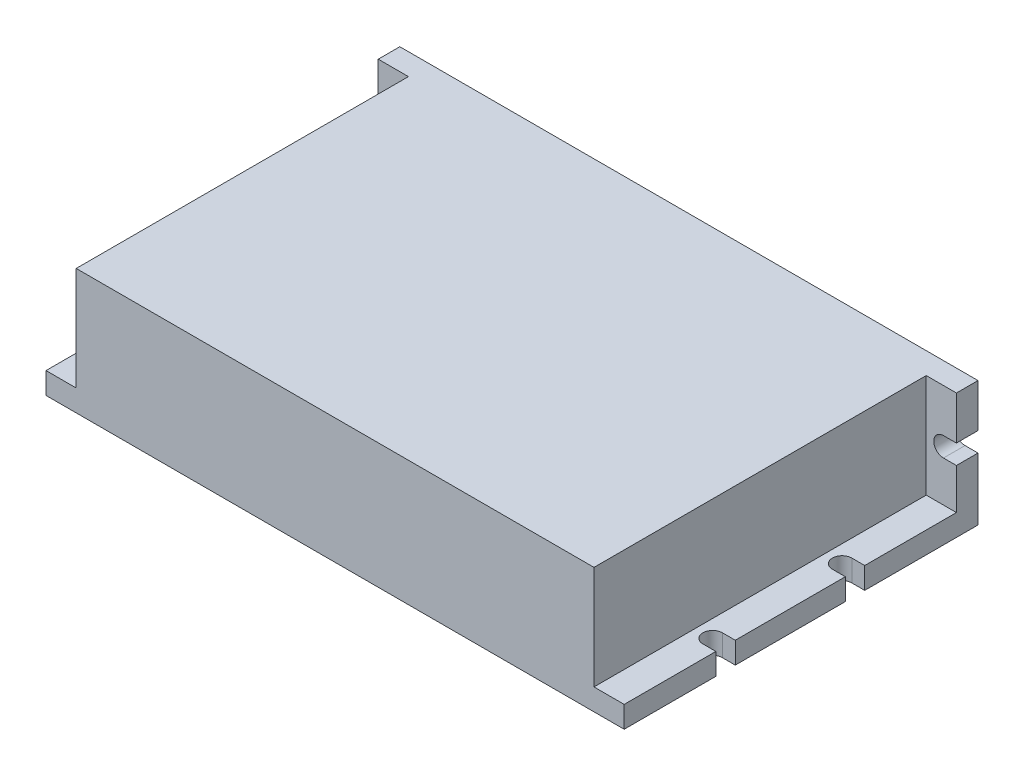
ISO-10303-21;
HEADER;
FILE_DESCRIPTION(('STEP AP214'),'2;1');
FILE_NAME('part.step','',(''),(''),'','','');
FILE_SCHEMA(('AUTOMOTIVE_DESIGN { 1 0 10303 214 1 1 1 1 }'));
ENDSEC;
DATA;
#1=APPLICATION_CONTEXT('core data for automotive mechanical design processes');
#2=APPLICATION_PROTOCOL_DEFINITION('international standard','automotive_design',2000,#1);
#3=PRODUCT_CONTEXT('',#1,'mechanical');
#4=PRODUCT('Part','Part','',(#3));
#5=PRODUCT_RELATED_PRODUCT_CATEGORY('part','',(#4));
#6=PRODUCT_DEFINITION_FORMATION('','',#4);
#7=PRODUCT_DEFINITION_CONTEXT('part definition',#1,'design');
#8=PRODUCT_DEFINITION('design','',#6,#7);
#9=PRODUCT_DEFINITION_SHAPE('','',#8);
#10=(LENGTH_UNIT() NAMED_UNIT(*) SI_UNIT(.MILLI.,.METRE.));
#11=(NAMED_UNIT(*) PLANE_ANGLE_UNIT() SI_UNIT($,.RADIAN.));
#12=(NAMED_UNIT(*) SI_UNIT($,.STERADIAN.) SOLID_ANGLE_UNIT());
#13=UNCERTAINTY_MEASURE_WITH_UNIT(LENGTH_MEASURE(1.E-05),#10,'distance_accuracy_value','');
#14=(GEOMETRIC_REPRESENTATION_CONTEXT(3) GLOBAL_UNCERTAINTY_ASSIGNED_CONTEXT((#13)) GLOBAL_UNIT_ASSIGNED_CONTEXT((#10,
#11,#12)) REPRESENTATION_CONTEXT('',''));
#15=CARTESIAN_POINT('',(0.,0.,0.));
#16=DIRECTION('',(0.,0.,1.));
#17=DIRECTION('',(1.,0.,0.));
#18=AXIS2_PLACEMENT_3D('',#15,#16,#17);
#19=CARTESIAN_POINT('',(134.,29.,0.));
#20=DIRECTION('',(-1.,0.,0.));
#21=DIRECTION('',(0.,0.,1.));
#22=AXIS2_PLACEMENT_3D('',#19,#20,#21);
#23=PLANE('',#22);
#24=DIRECTION('',(0.,0.,1.));
#25=VECTOR('',#24,1.);
#26=CARTESIAN_POINT('',(134.,5.,-77.));
#27=LINE('',#26,#25);
#28=CARTESIAN_POINT('',(134.,5.,-51.25));
#29=VERTEX_POINT('',#28);
#30=CARTESIAN_POINT('',(134.,5.,-25.75));
#31=VERTEX_POINT('',#30);
#32=EDGE_CURVE('E442',#29,#31,#27,.T.);
#33=ORIENTED_EDGE('',*,*,#32,.T.);
#34=DIRECTION('',(0.,1.,0.));
#35=VECTOR('',#34,1.);
#36=CARTESIAN_POINT('',(134.,0.,-25.75));
#37=LINE('',#36,#35);
#38=CARTESIAN_POINT('',(134.,0.,-25.75));
#39=VERTEX_POINT('',#38);
#40=EDGE_CURVE('E286',#39,#31,#37,.T.);
#41=ORIENTED_EDGE('',*,*,#40,.F.);
#42=DIRECTION('',(0.,0.,-1.));
#43=VECTOR('',#42,1.);
#44=CARTESIAN_POINT('',(134.,0.,0.));
#45=LINE('',#44,#43);
#46=CARTESIAN_POINT('',(134.,0.,-51.25));
#47=VERTEX_POINT('',#46);
#48=EDGE_CURVE('E495',#39,#47,#45,.T.);
#49=ORIENTED_EDGE('',*,*,#48,.T.);
#50=DIRECTION('',(0.,1.,0.));
#51=VECTOR('',#50,1.);
#52=CARTESIAN_POINT('',(134.,0.,-51.25));
#53=LINE('',#52,#51);
#54=EDGE_CURVE('E310',#47,#29,#53,.T.);
#55=ORIENTED_EDGE('',*,*,#54,.T.);
#56=EDGE_LOOP('',(#33,#41,#49,#55));
#57=FACE_BOUND('',#56,.T.);
#58=ADVANCED_FACE('F35',(#57),#23,.F.);
#59=CARTESIAN_POINT('',(134.,5.,-77.));
#60=VERTEX_POINT('',#59);
#61=CARTESIAN_POINT('',(134.,5.,-55.75));
#62=VERTEX_POINT('',#61);
#63=EDGE_CURVE('E438',#60,#62,#27,.T.);
#64=ORIENTED_EDGE('',*,*,#63,.T.);
#65=DIRECTION('',(0.,1.,0.));
#66=VECTOR('',#65,1.);
#67=CARTESIAN_POINT('',(134.,0.,-55.75));
#68=LINE('',#67,#66);
#69=CARTESIAN_POINT('',(134.,0.,-55.75));
#70=VERTEX_POINT('',#69);
#71=EDGE_CURVE('E308',#70,#62,#68,.T.);
#72=ORIENTED_EDGE('',*,*,#71,.F.);
#73=CARTESIAN_POINT('',(134.,0.,-82.));
#74=VERTEX_POINT('',#73);
#75=EDGE_CURVE('E492',#70,#74,#45,.T.);
#76=ORIENTED_EDGE('',*,*,#75,.T.);
#77=DIRECTION('',(0.,-1.,0.));
#78=VECTOR('',#77,1.);
#79=CARTESIAN_POINT('',(134.,29.,-82.));
#80=LINE('',#79,#78);
#81=CARTESIAN_POINT('',(134.,14.45,-82.));
#82=VERTEX_POINT('',#81);
#83=EDGE_CURVE('E501',#82,#74,#80,.T.);
#84=ORIENTED_EDGE('',*,*,#83,.F.);
#85=DIRECTION('',(0.,0.,1.));
#86=VECTOR('',#85,1.);
#87=CARTESIAN_POINT('',(134.,14.45,-129.));
#88=LINE('',#87,#86);
#89=CARTESIAN_POINT('',(134.,14.45,-77.));
#90=VERTEX_POINT('',#89);
#91=EDGE_CURVE('E401',#82,#90,#88,.T.);
#92=ORIENTED_EDGE('',*,*,#91,.T.);
#93=DIRECTION('',(0.,1.,0.));
#94=VECTOR('',#93,1.);
#95=CARTESIAN_POINT('',(134.,29.,-77.));
#96=LINE('',#95,#94);
#97=EDGE_CURVE('E419',#60,#90,#96,.T.);
#98=ORIENTED_EDGE('',*,*,#97,.F.);
#99=EDGE_LOOP('',(#64,#72,#76,#84,#92,#98));
#100=FACE_BOUND('',#99,.T.);
#101=ADVANCED_FACE('F547',(#100),#23,.F.);
#102=CARTESIAN_POINT('',(0.,29.,0.));
#103=DIRECTION('',(1.,0.,0.));
#104=DIRECTION('',(0.,0.,-1.));
#105=AXIS2_PLACEMENT_3D('',#102,#103,#104);
#106=PLANE('',#105);
#107=DIRECTION('',(0.,0.,1.));
#108=VECTOR('',#107,1.);
#109=CARTESIAN_POINT('',(0.,5.,-77.));
#110=LINE('',#109,#108);
#111=CARTESIAN_POINT('',(0.,5.,-51.25));
#112=VERTEX_POINT('',#111);
#113=CARTESIAN_POINT('',(0.,5.,-25.75));
#114=VERTEX_POINT('',#113);
#115=EDGE_CURVE('E472',#112,#114,#110,.T.);
#116=ORIENTED_EDGE('',*,*,#115,.F.);
#117=DIRECTION('',(0.,1.,0.));
#118=VECTOR('',#117,1.);
#119=CARTESIAN_POINT('',(0.,0.,-51.25));
#120=LINE('',#119,#118);
#121=CARTESIAN_POINT('',(0.,0.,-51.25));
#122=VERTEX_POINT('',#121);
#123=EDGE_CURVE('E333',#122,#112,#120,.T.);
#124=ORIENTED_EDGE('',*,*,#123,.F.);
#125=DIRECTION('',(0.,0.,1.));
#126=VECTOR('',#125,1.);
#127=CARTESIAN_POINT('',(0.,0.,0.));
#128=LINE('',#127,#126);
#129=CARTESIAN_POINT('',(0.,0.,-25.75));
#130=VERTEX_POINT('',#129);
#131=EDGE_CURVE('E489',#122,#130,#128,.T.);
#132=ORIENTED_EDGE('',*,*,#131,.T.);
#133=DIRECTION('',(0.,1.,0.));
#134=VECTOR('',#133,1.);
#135=CARTESIAN_POINT('',(0.,0.,-25.75));
#136=LINE('',#135,#134);
#137=EDGE_CURVE('E362',#130,#114,#136,.T.);
#138=ORIENTED_EDGE('',*,*,#137,.T.);
#139=EDGE_LOOP('',(#116,#124,#132,#138));
#140=FACE_BOUND('',#139,.T.);
#141=ADVANCED_FACE('F522',(#140),#106,.F.);
#142=CARTESIAN_POINT('',(0.,5.,-21.25));
#143=VERTEX_POINT('',#142);
#144=CARTESIAN_POINT('',(0.,5.,0.));
#145=VERTEX_POINT('',#144);
#146=EDGE_CURVE('E458',#143,#145,#110,.T.);
#147=ORIENTED_EDGE('',*,*,#146,.F.);
#148=DIRECTION('',(0.,1.,0.));
#149=VECTOR('',#148,1.);
#150=CARTESIAN_POINT('',(0.,0.,-21.25));
#151=LINE('',#150,#149);
#152=CARTESIAN_POINT('',(0.,0.,-21.25));
#153=VERTEX_POINT('',#152);
#154=EDGE_CURVE('E360',#153,#143,#151,.T.);
#155=ORIENTED_EDGE('',*,*,#154,.F.);
#156=CARTESIAN_POINT('',(0.,0.,0.));
#157=VERTEX_POINT('',#156);
#158=EDGE_CURVE('E466',#153,#157,#128,.T.);
#159=ORIENTED_EDGE('',*,*,#158,.T.);
#160=DIRECTION('',(0.,-1.,0.));
#161=VECTOR('',#160,1.);
#162=CARTESIAN_POINT('',(0.,29.,0.));
#163=LINE('',#162,#161);
#164=EDGE_CURVE('E11',#145,#157,#163,.T.);
#165=ORIENTED_EDGE('',*,*,#164,.F.);
#166=EDGE_LOOP('',(#147,#155,#159,#165));
#167=FACE_BOUND('',#166,.T.);
#168=ADVANCED_FACE('F539',(#167),#106,.F.);
#169=DIRECTION('',(0.,-1.,0.));
#170=VECTOR('',#169,1.);
#171=CARTESIAN_POINT('',(0.,29.,-82.));
#172=LINE('',#171,#170);
#173=CARTESIAN_POINT('',(0.,29.,-82.));
#174=VERTEX_POINT('',#173);
#175=CARTESIAN_POINT('',(0.,18.95,-82.));
#176=VERTEX_POINT('',#175);
#177=EDGE_CURVE('E498',#174,#176,#172,.T.);
#178=ORIENTED_EDGE('',*,*,#177,.T.);
#179=DIRECTION('',(0.,0.,1.));
#180=VECTOR('',#179,1.);
#181=CARTESIAN_POINT('',(0.,18.95,-129.));
#182=LINE('',#181,#180);
#183=CARTESIAN_POINT('',(0.,18.95,-77.));
#184=VERTEX_POINT('',#183);
#185=EDGE_CURVE('E375',#176,#184,#182,.T.);
#186=ORIENTED_EDGE('',*,*,#185,.T.);
#187=DIRECTION('',(0.,-1.,0.));
#188=VECTOR('',#187,1.);
#189=CARTESIAN_POINT('',(0.,29.,-77.));
#190=LINE('',#189,#188);
#191=CARTESIAN_POINT('',(0.,29.,-77.));
#192=VERTEX_POINT('',#191);
#193=EDGE_CURVE('E447',#192,#184,#190,.T.);
#194=ORIENTED_EDGE('',*,*,#193,.F.);
#195=DIRECTION('',(0.,0.,1.));
#196=VECTOR('',#195,1.);
#197=CARTESIAN_POINT('',(0.,29.,0.));
#198=LINE('',#197,#196);
#199=EDGE_CURVE('E473',#174,#192,#198,.T.);
#200=ORIENTED_EDGE('',*,*,#199,.F.);
#201=EDGE_LOOP('',(#178,#186,#194,#200));
#202=FACE_BOUND('',#201,.T.);
#203=ADVANCED_FACE('F541',(#202),#106,.F.);
#204=CARTESIAN_POINT('',(134.,0.,0.));
#205=VERTEX_POINT('',#204);
#206=CARTESIAN_POINT('',(134.,0.,-21.25));
#207=VERTEX_POINT('',#206);
#208=EDGE_CURVE('E493',#205,#207,#45,.T.);
#209=ORIENTED_EDGE('',*,*,#208,.T.);
#210=DIRECTION('',(0.,1.,0.));
#211=VECTOR('',#210,1.);
#212=CARTESIAN_POINT('',(134.,0.,-21.25));
#213=LINE('',#212,#211);
#214=CARTESIAN_POINT('',(134.,5.,-21.25));
#215=VERTEX_POINT('',#214);
#216=EDGE_CURVE('E262',#207,#215,#213,.T.);
#217=ORIENTED_EDGE('',*,*,#216,.T.);
#218=CARTESIAN_POINT('',(134.,5.,0.));
#219=VERTEX_POINT('',#218);
#220=EDGE_CURVE('E443',#215,#219,#27,.T.);
#221=ORIENTED_EDGE('',*,*,#220,.T.);
#222=DIRECTION('',(0.,-1.,0.));
#223=VECTOR('',#222,1.);
#224=CARTESIAN_POINT('',(134.,29.,0.));
#225=LINE('',#224,#223);
#226=EDGE_CURVE('E43',#219,#205,#225,.T.);
#227=ORIENTED_EDGE('',*,*,#226,.T.);
#228=EDGE_LOOP('',(#209,#217,#221,#227));
#229=FACE_BOUND('',#228,.T.);
#230=ADVANCED_FACE('F506',(#229),#23,.F.);
#231=CARTESIAN_POINT('',(0.,0.,-82.));
#232=VERTEX_POINT('',#231);
#233=CARTESIAN_POINT('',(0.,0.,-55.75));
#234=VERTEX_POINT('',#233);
#235=EDGE_CURVE('E485',#232,#234,#128,.T.);
#236=ORIENTED_EDGE('',*,*,#235,.T.);
#237=DIRECTION('',(0.,1.,0.));
#238=VECTOR('',#237,1.);
#239=CARTESIAN_POINT('',(0.,0.,-55.75));
#240=LINE('',#239,#238);
#241=CARTESIAN_POINT('',(0.,5.,-55.75));
#242=VERTEX_POINT('',#241);
#243=EDGE_CURVE('E335',#234,#242,#240,.T.);
#244=ORIENTED_EDGE('',*,*,#243,.T.);
#245=CARTESIAN_POINT('',(0.,5.,-77.));
#246=VERTEX_POINT('',#245);
#247=EDGE_CURVE('E469',#246,#242,#110,.T.);
#248=ORIENTED_EDGE('',*,*,#247,.F.);
#249=CARTESIAN_POINT('',(0.,14.45,-77.));
#250=VERTEX_POINT('',#249);
#251=EDGE_CURVE('E451',#250,#246,#190,.T.);
#252=ORIENTED_EDGE('',*,*,#251,.F.);
#253=DIRECTION('',(0.,0.,1.));
#254=VECTOR('',#253,1.);
#255=CARTESIAN_POINT('',(0.,14.45,-129.));
#256=LINE('',#255,#254);
#257=CARTESIAN_POINT('',(0.,14.45,-82.));
#258=VERTEX_POINT('',#257);
#259=EDGE_CURVE('E374',#258,#250,#256,.T.);
#260=ORIENTED_EDGE('',*,*,#259,.F.);
#261=EDGE_CURVE('E484',#258,#232,#172,.T.);
#262=ORIENTED_EDGE('',*,*,#261,.T.);
#263=EDGE_LOOP('',(#236,#244,#248,#252,#260,#262));
#264=FACE_BOUND('',#263,.T.);
#265=ADVANCED_FACE('F37',(#264),#106,.F.);
#266=CARTESIAN_POINT('',(0.,29.,0.));
#267=DIRECTION('',(0.,0.,-1.));
#268=DIRECTION('',(-1.,0.,0.));
#269=AXIS2_PLACEMENT_3D('',#266,#267,#268);
#270=PLANE('',#269);
#271=ORIENTED_EDGE('',*,*,#226,.F.);
#272=DIRECTION('',(1.,0.,0.));
#273=VECTOR('',#272,1.);
#274=CARTESIAN_POINT('',(134.,5.,0.));
#275=LINE('',#274,#273);
#276=CARTESIAN_POINT('',(127.,5.,0.));
#277=VERTEX_POINT('',#276);
#278=EDGE_CURVE('E435',#277,#219,#275,.T.);
#279=ORIENTED_EDGE('',*,*,#278,.F.);
#280=DIRECTION('',(0.,-1.,0.));
#281=VECTOR('',#280,1.);
#282=CARTESIAN_POINT('',(127.,29.,0.));
#283=LINE('',#282,#281);
#284=CARTESIAN_POINT('',(127.,29.,0.));
#285=VERTEX_POINT('',#284);
#286=EDGE_CURVE('E418',#285,#277,#283,.T.);
#287=ORIENTED_EDGE('',*,*,#286,.F.);
#288=DIRECTION('',(1.,0.,0.));
#289=VECTOR('',#288,1.);
#290=CARTESIAN_POINT('',(0.,29.,0.));
#291=LINE('',#290,#289);
#292=CARTESIAN_POINT('',(7.,29.,0.));
#293=VERTEX_POINT('',#292);
#294=EDGE_CURVE('E476',#293,#285,#291,.T.);
#295=ORIENTED_EDGE('',*,*,#294,.F.);
#296=DIRECTION('',(0.,1.,0.));
#297=VECTOR('',#296,1.);
#298=CARTESIAN_POINT('',(7.,29.,0.));
#299=LINE('',#298,#297);
#300=CARTESIAN_POINT('',(7.,5.,0.));
#301=VERTEX_POINT('',#300);
#302=EDGE_CURVE('E461',#301,#293,#299,.T.);
#303=ORIENTED_EDGE('',*,*,#302,.F.);
#304=DIRECTION('',(1.,0.,0.));
#305=VECTOR('',#304,1.);
#306=CARTESIAN_POINT('',(0.,5.,0.));
#307=LINE('',#306,#305);
#308=EDGE_CURVE('E441',#145,#301,#307,.T.);
#309=ORIENTED_EDGE('',*,*,#308,.F.);
#310=ORIENTED_EDGE('',*,*,#164,.T.);
#311=DIRECTION('',(1.,0.,0.));
#312=VECTOR('',#311,1.);
#313=CARTESIAN_POINT('',(0.,0.,0.));
#314=LINE('',#313,#312);
#315=EDGE_CURVE('E488',#157,#205,#314,.T.);
#316=ORIENTED_EDGE('',*,*,#315,.T.);
#317=EDGE_LOOP('',(#271,#279,#287,#295,#303,#309,#310,#316));
#318=FACE_BOUND('',#317,.T.);
#319=ADVANCED_FACE('F511',(#318),#270,.F.);
#320=CARTESIAN_POINT('',(134.,18.95,-77.));
#321=VERTEX_POINT('',#320);
#322=CARTESIAN_POINT('',(134.,29.,-77.));
#323=VERTEX_POINT('',#322);
#324=EDGE_CURVE('E423',#321,#323,#96,.T.);
#325=ORIENTED_EDGE('',*,*,#324,.F.);
#326=DIRECTION('',(0.,0.,1.));
#327=VECTOR('',#326,1.);
#328=CARTESIAN_POINT('',(134.,18.95,-129.));
#329=LINE('',#328,#327);
#330=CARTESIAN_POINT('',(134.,18.95,-82.));
#331=VERTEX_POINT('',#330);
#332=EDGE_CURVE('E400',#331,#321,#329,.T.);
#333=ORIENTED_EDGE('',*,*,#332,.F.);
#334=CARTESIAN_POINT('',(134.,29.,-82.));
#335=VERTEX_POINT('',#334);
#336=EDGE_CURVE('E502',#335,#331,#80,.T.);
#337=ORIENTED_EDGE('',*,*,#336,.F.);
#338=DIRECTION('',(0.,0.,-1.));
#339=VECTOR('',#338,1.);
#340=CARTESIAN_POINT('',(134.,29.,0.));
#341=LINE('',#340,#339);
#342=EDGE_CURVE('E480',#323,#335,#341,.T.);
#343=ORIENTED_EDGE('',*,*,#342,.F.);
#344=EDGE_LOOP('',(#325,#333,#337,#343));
#345=FACE_BOUND('',#344,.T.);
#346=ADVANCED_FACE('F551',(#345),#23,.F.);
#347=CARTESIAN_POINT('',(0.,29.,-82.));
#348=DIRECTION('',(0.,0.,1.));
#349=DIRECTION('',(1.,0.,0.));
#350=AXIS2_PLACEMENT_3D('',#347,#348,#349);
#351=PLANE('',#350);
#352=CARTESIAN_POINT('',(3.,16.7,-82.));
#353=DIRECTION('',(0.,0.,1.));
#354=DIRECTION('',(1.,0.,0.));
#355=AXIS2_PLACEMENT_3D('',#352,#353,#354);
#356=CIRCLE('',#355,2.25);
#357=CARTESIAN_POINT('',(3.,14.45,-82.));
#358=VERTEX_POINT('',#357);
#359=CARTESIAN_POINT('',(3.,18.95,-82.));
#360=VERTEX_POINT('',#359);
#361=EDGE_CURVE('E386',#358,#360,#356,.T.);
#362=ORIENTED_EDGE('',*,*,#361,.T.);
#363=DIRECTION('',(-1.,0.,0.));
#364=VECTOR('',#363,1.);
#365=CARTESIAN_POINT('',(0.,18.95,-82.));
#366=LINE('',#365,#364);
#367=EDGE_CURVE('E389',#360,#176,#366,.T.);
#368=ORIENTED_EDGE('',*,*,#367,.T.);
#369=ORIENTED_EDGE('',*,*,#177,.F.);
#370=DIRECTION('',(-1.,0.,0.));
#371=VECTOR('',#370,1.);
#372=CARTESIAN_POINT('',(0.,29.,-82.));
#373=LINE('',#372,#371);
#374=EDGE_CURVE('E482',#335,#174,#373,.T.);
#375=ORIENTED_EDGE('',*,*,#374,.F.);
#376=ORIENTED_EDGE('',*,*,#336,.T.);
#377=DIRECTION('',(-1.,0.,0.));
#378=VECTOR('',#377,1.);
#379=CARTESIAN_POINT('',(0.,18.95,-82.));
#380=LINE('',#379,#378);
#381=CARTESIAN_POINT('',(131.,18.95,-82.));
#382=VERTEX_POINT('',#381);
#383=EDGE_CURVE('E404',#331,#382,#380,.T.);
#384=ORIENTED_EDGE('',*,*,#383,.T.);
#385=CARTESIAN_POINT('',(131.,16.7,-82.));
#386=DIRECTION('',(0.,0.,1.));
#387=DIRECTION('',(1.,0.,0.));
#388=AXIS2_PLACEMENT_3D('',#385,#386,#387);
#389=CIRCLE('',#388,2.25);
#390=CARTESIAN_POINT('',(131.,14.45,-82.));
#391=VERTEX_POINT('',#390);
#392=EDGE_CURVE('E412',#382,#391,#389,.T.);
#393=ORIENTED_EDGE('',*,*,#392,.T.);
#394=DIRECTION('',(1.,0.,0.));
#395=VECTOR('',#394,1.);
#396=CARTESIAN_POINT('',(0.,14.4499999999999,-82.));
#397=LINE('',#396,#395);
#398=EDGE_CURVE('E415',#391,#82,#397,.T.);
#399=ORIENTED_EDGE('',*,*,#398,.T.);
#400=ORIENTED_EDGE('',*,*,#83,.T.);
#401=DIRECTION('',(-1.,0.,0.));
#402=VECTOR('',#401,1.);
#403=CARTESIAN_POINT('',(0.,0.,-82.));
#404=LINE('',#403,#402);
#405=EDGE_CURVE('E477',#74,#232,#404,.T.);
#406=ORIENTED_EDGE('',*,*,#405,.T.);
#407=ORIENTED_EDGE('',*,*,#261,.F.);
#408=DIRECTION('',(1.,0.,0.));
#409=VECTOR('',#408,1.);
#410=CARTESIAN_POINT('',(0.,14.45,-82.));
#411=LINE('',#410,#409);
#412=EDGE_CURVE('E378',#258,#358,#411,.T.);
#413=ORIENTED_EDGE('',*,*,#412,.T.);
#414=EDGE_LOOP('',(#362,#368,#369,#375,#376,#384,#393,#399,#400,#406,#407,#413));
#415=FACE_BOUND('',#414,.T.);
#416=ADVANCED_FACE('F559',(#415),#351,.F.);
#417=CARTESIAN_POINT('',(0.,29.,0.));
#418=DIRECTION('',(0.,-1.,0.));
#419=DIRECTION('',(0.,0.,-1.));
#420=AXIS2_PLACEMENT_3D('',#417,#418,#419);
#421=PLANE('',#420);
#422=ORIENTED_EDGE('',*,*,#294,.T.);
#423=DIRECTION('',(0.,0.,1.));
#424=VECTOR('',#423,1.);
#425=CARTESIAN_POINT('',(127.,29.,-77.));
#426=LINE('',#425,#424);
#427=CARTESIAN_POINT('',(127.,29.,-77.));
#428=VERTEX_POINT('',#427);
#429=EDGE_CURVE('E432',#428,#285,#426,.T.);
#430=ORIENTED_EDGE('',*,*,#429,.F.);
#431=DIRECTION('',(-1.,0.,0.));
#432=VECTOR('',#431,1.);
#433=CARTESIAN_POINT('',(134.,29.,-77.));
#434=LINE('',#433,#432);
#435=EDGE_CURVE('E422',#323,#428,#434,.T.);
#436=ORIENTED_EDGE('',*,*,#435,.F.);
#437=ORIENTED_EDGE('',*,*,#342,.T.);
#438=ORIENTED_EDGE('',*,*,#374,.T.);
#439=ORIENTED_EDGE('',*,*,#199,.T.);
#440=DIRECTION('',(-1.,0.,0.));
#441=VECTOR('',#440,1.);
#442=CARTESIAN_POINT('',(0.,29.,-77.));
#443=LINE('',#442,#441);
#444=CARTESIAN_POINT('',(7.,29.,-77.));
#445=VERTEX_POINT('',#444);
#446=EDGE_CURVE('E456',#445,#192,#443,.T.);
#447=ORIENTED_EDGE('',*,*,#446,.F.);
#448=DIRECTION('',(0.,0.,1.));
#449=VECTOR('',#448,1.);
#450=CARTESIAN_POINT('',(7.,29.,-77.));
#451=LINE('',#450,#449);
#452=EDGE_CURVE('E463',#445,#293,#451,.T.);
#453=ORIENTED_EDGE('',*,*,#452,.T.);
#454=EDGE_LOOP('',(#422,#430,#436,#437,#438,#439,#447,#453));
#455=FACE_BOUND('',#454,.T.);
#456=ADVANCED_FACE('F565',(#455),#421,.F.);
#457=CARTESIAN_POINT('',(0.,0.,0.));
#458=DIRECTION('',(0.,-1.,0.));
#459=DIRECTION('',(0.,0.,-1.));
#460=AXIS2_PLACEMENT_3D('',#457,#458,#459);
#461=PLANE('',#460);
#462=DIRECTION('',(-1.,0.,0.));
#463=VECTOR('',#462,1.);
#464=CARTESIAN_POINT('',(131.,0.,-25.75));
#465=LINE('',#464,#463);
#466=CARTESIAN_POINT('',(131.,0.,-25.75));
#467=VERTEX_POINT('',#466);
#468=EDGE_CURVE('E263',#39,#467,#465,.T.);
#469=ORIENTED_EDGE('',*,*,#468,.T.);
#470=CARTESIAN_POINT('',(131.,0.,-23.5));
#471=DIRECTION('',(0.,1.,0.));
#472=DIRECTION('',(0.,0.,1.));
#473=AXIS2_PLACEMENT_3D('',#470,#471,#472);
#474=CIRCLE('',#473,2.25);
#475=CARTESIAN_POINT('',(131.,0.,-21.25));
#476=VERTEX_POINT('',#475);
#477=EDGE_CURVE('E258',#467,#476,#474,.T.);
#478=ORIENTED_EDGE('',*,*,#477,.T.);
#479=DIRECTION('',(1.,0.,0.));
#480=VECTOR('',#479,1.);
#481=CARTESIAN_POINT('',(134.,0.,-21.25));
#482=LINE('',#481,#480);
#483=EDGE_CURVE('E266',#476,#207,#482,.T.);
#484=ORIENTED_EDGE('',*,*,#483,.T.);
#485=ORIENTED_EDGE('',*,*,#208,.F.);
#486=ORIENTED_EDGE('',*,*,#315,.F.);
#487=ORIENTED_EDGE('',*,*,#158,.F.);
#488=DIRECTION('',(1.,0.,0.));
#489=VECTOR('',#488,1.);
#490=CARTESIAN_POINT('',(0.,0.,-21.25));
#491=LINE('',#490,#489);
#492=CARTESIAN_POINT('',(3.,0.,-21.25));
#493=VERTEX_POINT('',#492);
#494=EDGE_CURVE('E347',#153,#493,#491,.T.);
#495=ORIENTED_EDGE('',*,*,#494,.T.);
#496=CARTESIAN_POINT('',(3.,0.,-23.5));
#497=DIRECTION('',(0.,1.,0.));
#498=DIRECTION('',(0.,0.,-1.));
#499=AXIS2_PLACEMENT_3D('',#496,#497,#498);
#500=CIRCLE('',#499,2.25);
#501=CARTESIAN_POINT('',(3.,0.,-25.75));
#502=VERTEX_POINT('',#501);
#503=EDGE_CURVE('E340',#493,#502,#500,.T.);
#504=ORIENTED_EDGE('',*,*,#503,.T.);
#505=DIRECTION('',(-1.,0.,0.));
#506=VECTOR('',#505,1.);
#507=CARTESIAN_POINT('',(3.,0.,-25.75));
#508=LINE('',#507,#506);
#509=EDGE_CURVE('E343',#502,#130,#508,.T.);
#510=ORIENTED_EDGE('',*,*,#509,.T.);
#511=ORIENTED_EDGE('',*,*,#131,.F.);
#512=DIRECTION('',(1.,0.,0.));
#513=VECTOR('',#512,1.);
#514=CARTESIAN_POINT('',(0.,0.,-51.25));
#515=LINE('',#514,#513);
#516=CARTESIAN_POINT('',(3.,0.,-51.25));
#517=VERTEX_POINT('',#516);
#518=EDGE_CURVE('E321',#122,#517,#515,.T.);
#519=ORIENTED_EDGE('',*,*,#518,.T.);
#520=CARTESIAN_POINT('',(3.,0.,-53.5));
#521=DIRECTION('',(0.,1.,0.));
#522=DIRECTION('',(0.,0.,-1.));
#523=AXIS2_PLACEMENT_3D('',#520,#521,#522);
#524=CIRCLE('',#523,2.25);
#525=CARTESIAN_POINT('',(3.,0.,-55.75));
#526=VERTEX_POINT('',#525);
#527=EDGE_CURVE('E314',#517,#526,#524,.T.);
#528=ORIENTED_EDGE('',*,*,#527,.T.);
#529=DIRECTION('',(-1.,0.,0.));
#530=VECTOR('',#529,1.);
#531=CARTESIAN_POINT('',(3.,0.,-55.75));
#532=LINE('',#531,#530);
#533=EDGE_CURVE('E317',#526,#234,#532,.T.);
#534=ORIENTED_EDGE('',*,*,#533,.T.);
#535=ORIENTED_EDGE('',*,*,#235,.F.);
#536=ORIENTED_EDGE('',*,*,#405,.F.);
#537=ORIENTED_EDGE('',*,*,#75,.F.);
#538=DIRECTION('',(-1.,0.,0.));
#539=VECTOR('',#538,1.);
#540=CARTESIAN_POINT('',(131.,0.,-55.75));
#541=LINE('',#540,#539);
#542=CARTESIAN_POINT('',(131.,0.,-55.75));
#543=VERTEX_POINT('',#542);
#544=EDGE_CURVE('E296',#70,#543,#541,.T.);
#545=ORIENTED_EDGE('',*,*,#544,.T.);
#546=CARTESIAN_POINT('',(131.,0.,-53.5));
#547=DIRECTION('',(0.,1.,0.));
#548=DIRECTION('',(0.,0.,1.));
#549=AXIS2_PLACEMENT_3D('',#546,#547,#548);
#550=CIRCLE('',#549,2.25);
#551=CARTESIAN_POINT('',(131.,0.,-51.25));
#552=VERTEX_POINT('',#551);
#553=EDGE_CURVE('E289',#543,#552,#550,.T.);
#554=ORIENTED_EDGE('',*,*,#553,.T.);
#555=DIRECTION('',(1.,0.,0.));
#556=VECTOR('',#555,1.);
#557=CARTESIAN_POINT('',(134.,0.,-51.25));
#558=LINE('',#557,#556);
#559=EDGE_CURVE('E292',#552,#47,#558,.T.);
#560=ORIENTED_EDGE('',*,*,#559,.T.);
#561=ORIENTED_EDGE('',*,*,#48,.F.);
#562=EDGE_LOOP('',(#469,#478,#484,#485,#486,#487,#495,#504,#510,#511,#519,#528,#534,#535,#536,
#537,#545,#554,#560,#561));
#563=FACE_BOUND('',#562,.T.);
#564=ADVANCED_FACE('F273',(#563),#461,.T.);
#565=CARTESIAN_POINT('',(7.,29.,-77.));
#566=DIRECTION('',(1.,0.,0.));
#567=DIRECTION('',(0.,1.,0.));
#568=AXIS2_PLACEMENT_3D('',#565,#566,#567);
#569=PLANE('',#568);
#570=ORIENTED_EDGE('',*,*,#302,.T.);
#571=ORIENTED_EDGE('',*,*,#452,.F.);
#572=DIRECTION('',(0.,1.,0.));
#573=VECTOR('',#572,1.);
#574=CARTESIAN_POINT('',(7.,29.,-77.));
#575=LINE('',#574,#573);
#576=CARTESIAN_POINT('',(7.,5.,-77.));
#577=VERTEX_POINT('',#576);
#578=EDGE_CURVE('E454',#577,#445,#575,.T.);
#579=ORIENTED_EDGE('',*,*,#578,.F.);
#580=DIRECTION('',(0.,0.,1.));
#581=VECTOR('',#580,1.);
#582=CARTESIAN_POINT('',(7.,5.,-77.));
#583=LINE('',#582,#581);
#584=EDGE_CURVE('E467',#577,#301,#583,.T.);
#585=ORIENTED_EDGE('',*,*,#584,.T.);
#586=EDGE_LOOP('',(#570,#571,#579,#585));
#587=FACE_BOUND('',#586,.T.);
#588=ADVANCED_FACE('F684',(#587),#569,.F.);
#589=CARTESIAN_POINT('',(0.,5.,-77.));
#590=DIRECTION('',(0.,-1.,0.));
#591=DIRECTION('',(0.,0.,-1.));
#592=AXIS2_PLACEMENT_3D('',#589,#590,#591);
#593=PLANE('',#592);
#594=CARTESIAN_POINT('',(3.,5.,-53.5));
#595=DIRECTION('',(0.,1.,0.));
#596=DIRECTION('',(0.,0.,-1.));
#597=AXIS2_PLACEMENT_3D('',#594,#595,#596);
#598=CIRCLE('',#597,2.25);
#599=CARTESIAN_POINT('',(3.,5.,-51.25));
#600=VERTEX_POINT('',#599);
#601=CARTESIAN_POINT('',(3.,5.,-55.75));
#602=VERTEX_POINT('',#601);
#603=EDGE_CURVE('E307',#600,#602,#598,.T.);
#604=ORIENTED_EDGE('',*,*,#603,.F.);
#605=DIRECTION('',(1.,0.,0.));
#606=VECTOR('',#605,1.);
#607=CARTESIAN_POINT('',(0.,5.,-51.25));
#608=LINE('',#607,#606);
#609=EDGE_CURVE('E318',#112,#600,#608,.T.);
#610=ORIENTED_EDGE('',*,*,#609,.F.);
#611=ORIENTED_EDGE('',*,*,#115,.T.);
#612=DIRECTION('',(-1.,0.,0.));
#613=VECTOR('',#612,1.);
#614=CARTESIAN_POINT('',(3.,5.,-25.75));
#615=LINE('',#614,#613);
#616=CARTESIAN_POINT('',(3.,5.,-25.75));
#617=VERTEX_POINT('',#616);
#618=EDGE_CURVE('E352',#617,#114,#615,.T.);
#619=ORIENTED_EDGE('',*,*,#618,.F.);
#620=CARTESIAN_POINT('',(3.,5.,-23.5));
#621=DIRECTION('',(0.,1.,0.));
#622=DIRECTION('',(0.,0.,-1.));
#623=AXIS2_PLACEMENT_3D('',#620,#621,#622);
#624=CIRCLE('',#623,2.25);
#625=CARTESIAN_POINT('',(3.,5.,-21.25));
#626=VERTEX_POINT('',#625);
#627=EDGE_CURVE('E332',#626,#617,#624,.T.);
#628=ORIENTED_EDGE('',*,*,#627,.F.);
#629=DIRECTION('',(1.,0.,0.));
#630=VECTOR('',#629,1.);
#631=CARTESIAN_POINT('',(0.,5.,-21.25));
#632=LINE('',#631,#630);
#633=EDGE_CURVE('E344',#143,#626,#632,.T.);
#634=ORIENTED_EDGE('',*,*,#633,.F.);
#635=ORIENTED_EDGE('',*,*,#146,.T.);
#636=ORIENTED_EDGE('',*,*,#308,.T.);
#637=ORIENTED_EDGE('',*,*,#584,.F.);
#638=DIRECTION('',(1.,0.,0.));
#639=VECTOR('',#638,1.);
#640=CARTESIAN_POINT('',(0.,5.,-77.));
#641=LINE('',#640,#639);
#642=EDGE_CURVE('E450',#246,#577,#641,.T.);
#643=ORIENTED_EDGE('',*,*,#642,.F.);
#644=ORIENTED_EDGE('',*,*,#247,.T.);
#645=DIRECTION('',(-1.,0.,0.));
#646=VECTOR('',#645,1.);
#647=CARTESIAN_POINT('',(3.,5.,-55.75));
#648=LINE('',#647,#646);
#649=EDGE_CURVE('E326',#602,#242,#648,.T.);
#650=ORIENTED_EDGE('',*,*,#649,.F.);
#651=EDGE_LOOP('',(#604,#610,#611,#619,#628,#634,#635,#636,#637,#643,#644,#650));
#652=FACE_BOUND('',#651,.T.);
#653=ADVANCED_FACE('F533',(#652),#593,.F.);
#654=CARTESIAN_POINT('',(0.,0.,-77.));
#655=DIRECTION('',(0.,0.,1.));
#656=DIRECTION('',(1.,0.,0.));
#657=AXIS2_PLACEMENT_3D('',#654,#655,#656);
#658=PLANE('',#657);
#659=DIRECTION('',(-1.,0.,0.));
#660=VECTOR('',#659,1.);
#661=CARTESIAN_POINT('',(3.,18.95,-77.));
#662=LINE('',#661,#660);
#663=CARTESIAN_POINT('',(3.,18.95,-77.));
#664=VERTEX_POINT('',#663);
#665=EDGE_CURVE('E372',#664,#184,#662,.T.);
#666=ORIENTED_EDGE('',*,*,#665,.F.);
#667=CARTESIAN_POINT('',(3.,16.7,-77.));
#668=DIRECTION('',(0.,0.,1.));
#669=DIRECTION('',(-1.,0.,0.));
#670=AXIS2_PLACEMENT_3D('',#667,#668,#669);
#671=CIRCLE('',#670,2.25);
#672=CARTESIAN_POINT('',(3.,14.45,-77.));
#673=VERTEX_POINT('',#672);
#674=EDGE_CURVE('E369',#673,#664,#671,.T.);
#675=ORIENTED_EDGE('',*,*,#674,.F.);
#676=DIRECTION('',(1.,0.,0.));
#677=VECTOR('',#676,1.);
#678=CARTESIAN_POINT('',(0.,14.45,-77.));
#679=LINE('',#678,#677);
#680=EDGE_CURVE('E359',#250,#673,#679,.T.);
#681=ORIENTED_EDGE('',*,*,#680,.F.);
#682=ORIENTED_EDGE('',*,*,#251,.T.);
#683=ORIENTED_EDGE('',*,*,#642,.T.);
#684=ORIENTED_EDGE('',*,*,#578,.T.);
#685=ORIENTED_EDGE('',*,*,#446,.T.);
#686=ORIENTED_EDGE('',*,*,#193,.T.);
#687=EDGE_LOOP('',(#666,#675,#681,#682,#683,#684,#685,#686));
#688=FACE_BOUND('',#687,.T.);
#689=ADVANCED_FACE('F591',(#688),#658,.T.);
#690=CARTESIAN_POINT('',(134.,5.,-77.));
#691=DIRECTION('',(0.,-1.,0.));
#692=DIRECTION('',(1.,0.,0.));
#693=AXIS2_PLACEMENT_3D('',#690,#691,#692);
#694=PLANE('',#693);
#695=CARTESIAN_POINT('',(131.,5.,-23.5));
#696=DIRECTION('',(0.,1.,0.));
#697=DIRECTION('',(0.,0.,1.));
#698=AXIS2_PLACEMENT_3D('',#695,#696,#697);
#699=CIRCLE('',#698,2.25);
#700=CARTESIAN_POINT('',(131.,5.,-25.75));
#701=VERTEX_POINT('',#700);
#702=CARTESIAN_POINT('',(131.,5.,-21.25));
#703=VERTEX_POINT('',#702);
#704=EDGE_CURVE('E50',#701,#703,#699,.T.);
#705=ORIENTED_EDGE('',*,*,#704,.F.);
#706=DIRECTION('',(-1.,0.,0.));
#707=VECTOR('',#706,1.);
#708=CARTESIAN_POINT('',(131.,5.,-25.75));
#709=LINE('',#708,#707);
#710=EDGE_CURVE('E275',#31,#701,#709,.T.);
#711=ORIENTED_EDGE('',*,*,#710,.F.);
#712=ORIENTED_EDGE('',*,*,#32,.F.);
#713=DIRECTION('',(1.,0.,0.));
#714=VECTOR('',#713,1.);
#715=CARTESIAN_POINT('',(134.,5.,-51.25));
#716=LINE('',#715,#714);
#717=CARTESIAN_POINT('',(131.,5.,-51.25));
#718=VERTEX_POINT('',#717);
#719=EDGE_CURVE('E301',#718,#29,#716,.T.);
#720=ORIENTED_EDGE('',*,*,#719,.F.);
#721=CARTESIAN_POINT('',(131.,5.,-53.5));
#722=DIRECTION('',(0.,1.,0.));
#723=DIRECTION('',(0.,0.,1.));
#724=AXIS2_PLACEMENT_3D('',#721,#722,#723);
#725=CIRCLE('',#724,2.25);
#726=CARTESIAN_POINT('',(131.,5.,-55.75));
#727=VERTEX_POINT('',#726);
#728=EDGE_CURVE('E58',#727,#718,#725,.T.);
#729=ORIENTED_EDGE('',*,*,#728,.F.);
#730=DIRECTION('',(-1.,0.,0.));
#731=VECTOR('',#730,1.);
#732=CARTESIAN_POINT('',(131.,5.,-55.75));
#733=LINE('',#732,#731);
#734=EDGE_CURVE('E293',#62,#727,#733,.T.);
#735=ORIENTED_EDGE('',*,*,#734,.F.);
#736=ORIENTED_EDGE('',*,*,#63,.F.);
#737=DIRECTION('',(1.,0.,0.));
#738=VECTOR('',#737,1.);
#739=CARTESIAN_POINT('',(134.,5.,-77.));
#740=LINE('',#739,#738);
#741=CARTESIAN_POINT('',(127.,5.,-77.));
#742=VERTEX_POINT('',#741);
#743=EDGE_CURVE('E429',#742,#60,#740,.T.);
#744=ORIENTED_EDGE('',*,*,#743,.F.);
#745=DIRECTION('',(0.,0.,1.));
#746=VECTOR('',#745,1.);
#747=CARTESIAN_POINT('',(127.,5.,-77.));
#748=LINE('',#747,#746);
#749=EDGE_CURVE('E444',#742,#277,#748,.T.);
#750=ORIENTED_EDGE('',*,*,#749,.T.);
#751=ORIENTED_EDGE('',*,*,#278,.T.);
#752=ORIENTED_EDGE('',*,*,#220,.F.);
#753=DIRECTION('',(1.,0.,0.));
#754=VECTOR('',#753,1.);
#755=CARTESIAN_POINT('',(134.,5.,-21.25));
#756=LINE('',#755,#754);
#757=EDGE_CURVE('E278',#703,#215,#756,.T.);
#758=ORIENTED_EDGE('',*,*,#757,.F.);
#759=EDGE_LOOP('',(#705,#711,#712,#720,#729,#735,#736,#744,#750,#751,#752,#758));
#760=FACE_BOUND('',#759,.T.);
#761=ADVANCED_FACE('F610',(#760),#694,.F.);
#762=CARTESIAN_POINT('',(127.,29.,-77.));
#763=DIRECTION('',(-1.,0.,0.));
#764=DIRECTION('',(0.,0.,1.));
#765=AXIS2_PLACEMENT_3D('',#762,#763,#764);
#766=PLANE('',#765);
#767=ORIENTED_EDGE('',*,*,#286,.T.);
#768=ORIENTED_EDGE('',*,*,#749,.F.);
#769=DIRECTION('',(0.,-1.,0.));
#770=VECTOR('',#769,1.);
#771=CARTESIAN_POINT('',(127.,29.,-77.));
#772=LINE('',#771,#770);
#773=EDGE_CURVE('E426',#428,#742,#772,.T.);
#774=ORIENTED_EDGE('',*,*,#773,.F.);
#775=ORIENTED_EDGE('',*,*,#429,.T.);
#776=EDGE_LOOP('',(#767,#768,#774,#775));
#777=FACE_BOUND('',#776,.T.);
#778=ADVANCED_FACE('F675',(#777),#766,.F.);
#779=CARTESIAN_POINT('',(0.,0.,-77.));
#780=DIRECTION('',(0.,0.,-1.));
#781=DIRECTION('',(-1.,0.,0.));
#782=AXIS2_PLACEMENT_3D('',#779,#780,#781);
#783=PLANE('',#782);
#784=ORIENTED_EDGE('',*,*,#97,.T.);
#785=DIRECTION('',(1.,0.,0.));
#786=VECTOR('',#785,1.);
#787=CARTESIAN_POINT('',(134.,14.45,-77.));
#788=LINE('',#787,#786);
#789=CARTESIAN_POINT('',(131.,14.45,-77.));
#790=VERTEX_POINT('',#789);
#791=EDGE_CURVE('E398',#790,#90,#788,.T.);
#792=ORIENTED_EDGE('',*,*,#791,.F.);
#793=CARTESIAN_POINT('',(131.,16.7,-77.));
#794=DIRECTION('',(0.,0.,1.));
#795=DIRECTION('',(1.,0.,0.));
#796=AXIS2_PLACEMENT_3D('',#793,#794,#795);
#797=CIRCLE('',#796,2.25);
#798=CARTESIAN_POINT('',(131.,18.95,-77.));
#799=VERTEX_POINT('',#798);
#800=EDGE_CURVE('E395',#799,#790,#797,.T.);
#801=ORIENTED_EDGE('',*,*,#800,.F.);
#802=DIRECTION('',(-1.,0.,0.));
#803=VECTOR('',#802,1.);
#804=CARTESIAN_POINT('',(131.,18.95,-77.));
#805=LINE('',#804,#803);
#806=EDGE_CURVE('E392',#321,#799,#805,.T.);
#807=ORIENTED_EDGE('',*,*,#806,.F.);
#808=ORIENTED_EDGE('',*,*,#324,.T.);
#809=ORIENTED_EDGE('',*,*,#435,.T.);
#810=ORIENTED_EDGE('',*,*,#773,.T.);
#811=ORIENTED_EDGE('',*,*,#743,.T.);
#812=EDGE_LOOP('',(#784,#792,#801,#807,#808,#809,#810,#811));
#813=FACE_BOUND('',#812,.T.);
#814=ADVANCED_FACE('F665',(#813),#783,.F.);
#815=CARTESIAN_POINT('',(134.,14.45,-129.));
#816=DIRECTION('',(0.,-1.,0.));
#817=DIRECTION('',(1.,0.,0.));
#818=AXIS2_PLACEMENT_3D('',#815,#816,#817);
#819=PLANE('',#818);
#820=DIRECTION('',(0.,0.,1.));
#821=VECTOR('',#820,1.);
#822=CARTESIAN_POINT('',(131.,14.45,-129.));
#823=LINE('',#822,#821);
#824=EDGE_CURVE('E405',#391,#790,#823,.T.);
#825=ORIENTED_EDGE('',*,*,#824,.T.);
#826=ORIENTED_EDGE('',*,*,#791,.T.);
#827=ORIENTED_EDGE('',*,*,#91,.F.);
#828=ORIENTED_EDGE('',*,*,#398,.F.);
#829=EDGE_LOOP('',(#825,#826,#827,#828));
#830=FACE_BOUND('',#829,.T.);
#831=ADVANCED_FACE('F661',(#830),#819,.F.);
#832=CARTESIAN_POINT('',(131.,16.7,-129.));
#833=DIRECTION('',(0.,0.,1.));
#834=DIRECTION('',(1.,0.,0.));
#835=AXIS2_PLACEMENT_3D('',#832,#833,#834);
#836=CYLINDRICAL_SURFACE('',#835,2.25);
#837=DIRECTION('',(0.,0.,1.));
#838=VECTOR('',#837,1.);
#839=CARTESIAN_POINT('',(131.,18.95,-129.));
#840=LINE('',#839,#838);
#841=EDGE_CURVE('E407',#382,#799,#840,.T.);
#842=ORIENTED_EDGE('',*,*,#841,.T.);
#843=ORIENTED_EDGE('',*,*,#800,.T.);
#844=ORIENTED_EDGE('',*,*,#824,.F.);
#845=ORIENTED_EDGE('',*,*,#392,.F.);
#846=EDGE_LOOP('',(#842,#843,#844,#845));
#847=FACE_BOUND('',#846,.T.);
#848=ADVANCED_FACE('F664',(#847),#836,.F.);
#849=CARTESIAN_POINT('',(131.,18.95,-129.));
#850=DIRECTION('',(0.,1.,0.));
#851=DIRECTION('',(0.,0.,1.));
#852=AXIS2_PLACEMENT_3D('',#849,#850,#851);
#853=PLANE('',#852);
#854=ORIENTED_EDGE('',*,*,#332,.T.);
#855=ORIENTED_EDGE('',*,*,#806,.T.);
#856=ORIENTED_EDGE('',*,*,#841,.F.);
#857=ORIENTED_EDGE('',*,*,#383,.F.);
#858=EDGE_LOOP('',(#854,#855,#856,#857));
#859=FACE_BOUND('',#858,.T.);
#860=ADVANCED_FACE('F654',(#859),#853,.F.);
#861=CARTESIAN_POINT('',(3.,18.95,-129.));
#862=DIRECTION('',(0.,1.,0.));
#863=DIRECTION('',(0.,0.,1.));
#864=AXIS2_PLACEMENT_3D('',#861,#862,#863);
#865=PLANE('',#864);
#866=DIRECTION('',(0.,0.,1.));
#867=VECTOR('',#866,1.);
#868=CARTESIAN_POINT('',(3.,18.95,-129.));
#869=LINE('',#868,#867);
#870=EDGE_CURVE('E379',#360,#664,#869,.T.);
#871=ORIENTED_EDGE('',*,*,#870,.T.);
#872=ORIENTED_EDGE('',*,*,#665,.T.);
#873=ORIENTED_EDGE('',*,*,#185,.F.);
#874=ORIENTED_EDGE('',*,*,#367,.F.);
#875=EDGE_LOOP('',(#871,#872,#873,#874));
#876=FACE_BOUND('',#875,.T.);
#877=ADVANCED_FACE('F650',(#876),#865,.F.);
#878=CARTESIAN_POINT('',(3.,16.7,-129.));
#879=DIRECTION('',(0.,0.,1.));
#880=DIRECTION('',(1.,0.,0.));
#881=AXIS2_PLACEMENT_3D('',#878,#879,#880);
#882=CYLINDRICAL_SURFACE('',#881,2.25);
#883=DIRECTION('',(0.,0.,1.));
#884=VECTOR('',#883,1.);
#885=CARTESIAN_POINT('',(3.,14.45,-129.));
#886=LINE('',#885,#884);
#887=EDGE_CURVE('E381',#358,#673,#886,.T.);
#888=ORIENTED_EDGE('',*,*,#887,.T.);
#889=ORIENTED_EDGE('',*,*,#674,.T.);
#890=ORIENTED_EDGE('',*,*,#870,.F.);
#891=ORIENTED_EDGE('',*,*,#361,.F.);
#892=EDGE_LOOP('',(#888,#889,#890,#891));
#893=FACE_BOUND('',#892,.T.);
#894=ADVANCED_FACE('F653',(#893),#882,.F.);
#895=CARTESIAN_POINT('',(0.,14.45,-129.));
#896=DIRECTION('',(0.,-1.,0.));
#897=DIRECTION('',(0.,0.,-1.));
#898=AXIS2_PLACEMENT_3D('',#895,#896,#897);
#899=PLANE('',#898);
#900=ORIENTED_EDGE('',*,*,#259,.T.);
#901=ORIENTED_EDGE('',*,*,#680,.T.);
#902=ORIENTED_EDGE('',*,*,#887,.F.);
#903=ORIENTED_EDGE('',*,*,#412,.F.);
#904=EDGE_LOOP('',(#900,#901,#902,#903));
#905=FACE_BOUND('',#904,.T.);
#906=ADVANCED_FACE('F595',(#905),#899,.F.);
#907=CARTESIAN_POINT('',(3.,0.,-23.5));
#908=DIRECTION('',(0.,1.,0.));
#909=DIRECTION('',(0.,0.,1.));
#910=AXIS2_PLACEMENT_3D('',#907,#908,#909);
#911=CYLINDRICAL_SURFACE('',#910,2.25);
#912=ORIENTED_EDGE('',*,*,#627,.T.);
#913=DIRECTION('',(0.,1.,0.));
#914=VECTOR('',#913,1.);
#915=CARTESIAN_POINT('',(3.,0.,-25.75));
#916=LINE('',#915,#914);
#917=EDGE_CURVE('E350',#502,#617,#916,.T.);
#918=ORIENTED_EDGE('',*,*,#917,.F.);
#919=ORIENTED_EDGE('',*,*,#503,.F.);
#920=DIRECTION('',(0.,1.,0.));
#921=VECTOR('',#920,1.);
#922=CARTESIAN_POINT('',(3.,0.,-21.25));
#923=LINE('',#922,#921);
#924=EDGE_CURVE('E357',#493,#626,#923,.T.);
#925=ORIENTED_EDGE('',*,*,#924,.T.);
#926=EDGE_LOOP('',(#912,#918,#919,#925));
#927=FACE_BOUND('',#926,.T.);
#928=ADVANCED_FACE('F529',(#927),#911,.F.);
#929=CARTESIAN_POINT('',(0.,0.,-21.25));
#930=DIRECTION('',(0.,0.,1.));
#931=DIRECTION('',(1.,0.,0.));
#932=AXIS2_PLACEMENT_3D('',#929,#930,#931);
#933=PLANE('',#932);
#934=ORIENTED_EDGE('',*,*,#633,.T.);
#935=ORIENTED_EDGE('',*,*,#924,.F.);
#936=ORIENTED_EDGE('',*,*,#494,.F.);
#937=ORIENTED_EDGE('',*,*,#154,.T.);
#938=EDGE_LOOP('',(#934,#935,#936,#937));
#939=FACE_BOUND('',#938,.T.);
#940=ADVANCED_FACE('F642',(#939),#933,.F.);
#941=CARTESIAN_POINT('',(3.,0.,-25.75));
#942=DIRECTION('',(0.,0.,-1.));
#943=DIRECTION('',(-1.,0.,0.));
#944=AXIS2_PLACEMENT_3D('',#941,#942,#943);
#945=PLANE('',#944);
#946=ORIENTED_EDGE('',*,*,#618,.T.);
#947=ORIENTED_EDGE('',*,*,#137,.F.);
#948=ORIENTED_EDGE('',*,*,#509,.F.);
#949=ORIENTED_EDGE('',*,*,#917,.T.);
#950=EDGE_LOOP('',(#946,#947,#948,#949));
#951=FACE_BOUND('',#950,.T.);
#952=ADVANCED_FACE('F525',(#951),#945,.F.);
#953=CARTESIAN_POINT('',(3.,0.,-53.5));
#954=DIRECTION('',(0.,1.,0.));
#955=DIRECTION('',(0.,0.,1.));
#956=AXIS2_PLACEMENT_3D('',#953,#954,#955);
#957=CYLINDRICAL_SURFACE('',#956,2.25);
#958=ORIENTED_EDGE('',*,*,#603,.T.);
#959=DIRECTION('',(0.,1.,0.));
#960=VECTOR('',#959,1.);
#961=CARTESIAN_POINT('',(3.,0.,-55.75));
#962=LINE('',#961,#960);
#963=EDGE_CURVE('E324',#526,#602,#962,.T.);
#964=ORIENTED_EDGE('',*,*,#963,.F.);
#965=ORIENTED_EDGE('',*,*,#527,.F.);
#966=DIRECTION('',(0.,1.,0.));
#967=VECTOR('',#966,1.);
#968=CARTESIAN_POINT('',(3.,0.,-51.25));
#969=LINE('',#968,#967);
#970=EDGE_CURVE('E330',#517,#600,#969,.T.);
#971=ORIENTED_EDGE('',*,*,#970,.T.);
#972=EDGE_LOOP('',(#958,#964,#965,#971));
#973=FACE_BOUND('',#972,.T.);
#974=ADVANCED_FACE('F635',(#973),#957,.F.);
#975=CARTESIAN_POINT('',(0.,0.,-51.25));
#976=DIRECTION('',(0.,0.,1.));
#977=DIRECTION('',(1.,0.,0.));
#978=AXIS2_PLACEMENT_3D('',#975,#976,#977);
#979=PLANE('',#978);
#980=ORIENTED_EDGE('',*,*,#609,.T.);
#981=ORIENTED_EDGE('',*,*,#970,.F.);
#982=ORIENTED_EDGE('',*,*,#518,.F.);
#983=ORIENTED_EDGE('',*,*,#123,.T.);
#984=EDGE_LOOP('',(#980,#981,#982,#983));
#985=FACE_BOUND('',#984,.T.);
#986=ADVANCED_FACE('F632',(#985),#979,.F.);
#987=CARTESIAN_POINT('',(3.,0.,-55.75));
#988=DIRECTION('',(0.,0.,-1.));
#989=DIRECTION('',(-1.,0.,0.));
#990=AXIS2_PLACEMENT_3D('',#987,#988,#989);
#991=PLANE('',#990);
#992=ORIENTED_EDGE('',*,*,#649,.T.);
#993=ORIENTED_EDGE('',*,*,#243,.F.);
#994=ORIENTED_EDGE('',*,*,#533,.F.);
#995=ORIENTED_EDGE('',*,*,#963,.T.);
#996=EDGE_LOOP('',(#992,#993,#994,#995));
#997=FACE_BOUND('',#996,.T.);
#998=ADVANCED_FACE('F584',(#997),#991,.F.);
#999=CARTESIAN_POINT('',(131.,0.,-53.5));
#1000=DIRECTION('',(0.,1.,0.));
#1001=DIRECTION('',(0.,0.,1.));
#1002=AXIS2_PLACEMENT_3D('',#999,#1000,#1001);
#1003=CYLINDRICAL_SURFACE('',#1002,2.25);
#1004=ORIENTED_EDGE('',*,*,#728,.T.);
#1005=DIRECTION('',(0.,1.,0.));
#1006=VECTOR('',#1005,1.);
#1007=CARTESIAN_POINT('',(131.,0.,-51.25));
#1008=LINE('',#1007,#1006);
#1009=EDGE_CURVE('E299',#552,#718,#1008,.T.);
#1010=ORIENTED_EDGE('',*,*,#1009,.F.);
#1011=ORIENTED_EDGE('',*,*,#553,.F.);
#1012=DIRECTION('',(0.,1.,0.));
#1013=VECTOR('',#1012,1.);
#1014=CARTESIAN_POINT('',(131.,0.,-55.75));
#1015=LINE('',#1014,#1013);
#1016=EDGE_CURVE('E305',#543,#727,#1015,.T.);
#1017=ORIENTED_EDGE('',*,*,#1016,.T.);
#1018=EDGE_LOOP('',(#1004,#1010,#1011,#1017));
#1019=FACE_BOUND('',#1018,.T.);
#1020=ADVANCED_FACE('F608',(#1019),#1003,.F.);
#1021=CARTESIAN_POINT('',(131.,0.,-55.75));
#1022=DIRECTION('',(0.,0.,-1.));
#1023=DIRECTION('',(-1.,0.,0.));
#1024=AXIS2_PLACEMENT_3D('',#1021,#1022,#1023);
#1025=PLANE('',#1024);
#1026=ORIENTED_EDGE('',*,*,#734,.T.);
#1027=ORIENTED_EDGE('',*,*,#1016,.F.);
#1028=ORIENTED_EDGE('',*,*,#544,.F.);
#1029=ORIENTED_EDGE('',*,*,#71,.T.);
#1030=EDGE_LOOP('',(#1026,#1027,#1028,#1029));
#1031=FACE_BOUND('',#1030,.T.);
#1032=ADVANCED_FACE('F624',(#1031),#1025,.F.);
#1033=CARTESIAN_POINT('',(134.,0.,-51.25));
#1034=DIRECTION('',(0.,0.,1.));
#1035=DIRECTION('',(1.,0.,0.));
#1036=AXIS2_PLACEMENT_3D('',#1033,#1034,#1035);
#1037=PLANE('',#1036);
#1038=ORIENTED_EDGE('',*,*,#719,.T.);
#1039=ORIENTED_EDGE('',*,*,#54,.F.);
#1040=ORIENTED_EDGE('',*,*,#559,.F.);
#1041=ORIENTED_EDGE('',*,*,#1009,.T.);
#1042=EDGE_LOOP('',(#1038,#1039,#1040,#1041));
#1043=FACE_BOUND('',#1042,.T.);
#1044=ADVANCED_FACE('F605',(#1043),#1037,.F.);
#1045=CARTESIAN_POINT('',(131.,0.,-23.5));
#1046=DIRECTION('',(0.,1.,0.));
#1047=DIRECTION('',(0.,0.,1.));
#1048=AXIS2_PLACEMENT_3D('',#1045,#1046,#1047);
#1049=CYLINDRICAL_SURFACE('',#1048,2.25);
#1050=ORIENTED_EDGE('',*,*,#704,.T.);
#1051=DIRECTION('',(0.,1.,0.));
#1052=VECTOR('',#1051,1.);
#1053=CARTESIAN_POINT('',(131.,0.,-21.25));
#1054=LINE('',#1053,#1052);
#1055=EDGE_CURVE('E254',#476,#703,#1054,.T.);
#1056=ORIENTED_EDGE('',*,*,#1055,.F.);
#1057=ORIENTED_EDGE('',*,*,#477,.F.);
#1058=DIRECTION('',(0.,1.,0.));
#1059=VECTOR('',#1058,1.);
#1060=CARTESIAN_POINT('',(131.,0.,-25.75));
#1061=LINE('',#1060,#1059);
#1062=EDGE_CURVE('E284',#467,#701,#1061,.T.);
#1063=ORIENTED_EDGE('',*,*,#1062,.T.);
#1064=EDGE_LOOP('',(#1050,#1056,#1057,#1063));
#1065=FACE_BOUND('',#1064,.T.);
#1066=ADVANCED_FACE('F256',(#1065),#1049,.F.);
#1067=CARTESIAN_POINT('',(131.,0.,-25.75));
#1068=DIRECTION('',(0.,0.,-1.));
#1069=DIRECTION('',(-1.,0.,0.));
#1070=AXIS2_PLACEMENT_3D('',#1067,#1068,#1069);
#1071=PLANE('',#1070);
#1072=ORIENTED_EDGE('',*,*,#710,.T.);
#1073=ORIENTED_EDGE('',*,*,#1062,.F.);
#1074=ORIENTED_EDGE('',*,*,#468,.F.);
#1075=ORIENTED_EDGE('',*,*,#40,.T.);
#1076=EDGE_LOOP('',(#1072,#1073,#1074,#1075));
#1077=FACE_BOUND('',#1076,.T.);
#1078=ADVANCED_FACE('F614',(#1077),#1071,.F.);
#1079=CARTESIAN_POINT('',(134.,0.,-21.25));
#1080=DIRECTION('',(0.,0.,1.));
#1081=DIRECTION('',(1.,0.,0.));
#1082=AXIS2_PLACEMENT_3D('',#1079,#1080,#1081);
#1083=PLANE('',#1082);
#1084=ORIENTED_EDGE('',*,*,#757,.T.);
#1085=ORIENTED_EDGE('',*,*,#216,.F.);
#1086=ORIENTED_EDGE('',*,*,#483,.F.);
#1087=ORIENTED_EDGE('',*,*,#1055,.T.);
#1088=EDGE_LOOP('',(#1084,#1085,#1086,#1087));
#1089=FACE_BOUND('',#1088,.T.);
#1090=ADVANCED_FACE('F267',(#1089),#1083,.F.);
#1091=CLOSED_SHELL('',(#58,#101,#141,#168,#203,#230,#265,#319,#346,#416,#456,#564,#588,#653,
#689,#761,#778,#814,#831,#848,#860,#877,#894,#906,#928,#940,#952,#974,#986,#998,#1020,#1032,
#1044,#1066,#1078,#1090));
#1092=MANIFOLD_SOLID_BREP('B2',#1091);
#1093=ADVANCED_BREP_SHAPE_REPRESENTATION('',(#18,#1092),#14);
#1094=SHAPE_DEFINITION_REPRESENTATION(#9,#1093);
ENDSEC;
END-ISO-10303-21;
